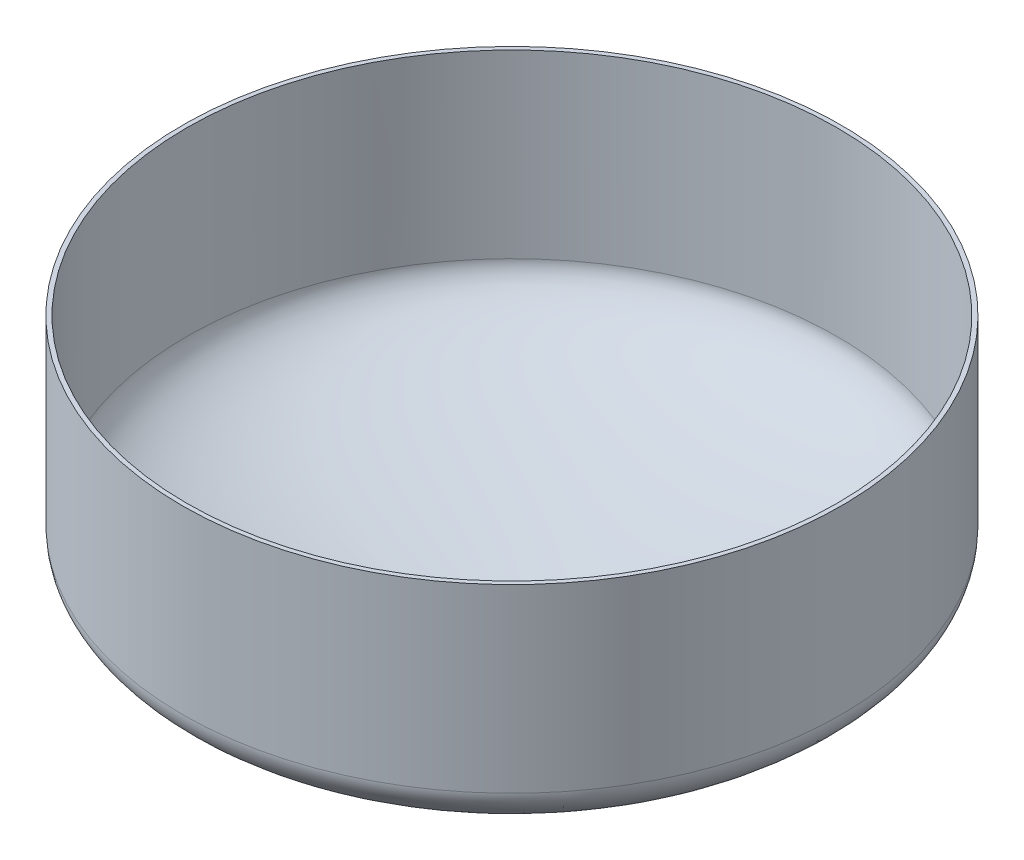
from build123d import *

# Parameters (mm, degrees)
WANDUNG1_T              = -2.5
SKIZZE2_R               = 9.25
LINEAR_AUSTRAGEN1_DEPTH = 316.317300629
SKIZZE4_R               = 15
LINEAR_AUSTRAGEN2_DEPTH = 378.274577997


with BuildPart() as part:
    # Skizze1 → Rotation1 (revolve)
    with BuildSketch(Plane(origin=(0, 0, 0), x_dir=(0, 0, -1), z_dir=(1, 0, 0)), mode=Mode.PRIVATE) as rotation1_sk:
        with BuildLine():
            Line((190, 165), (0, 165))
            Line((0, 165), (0, 0))
            Line((0, 0), (30, 0))
            add(Edge.make_bspline(
                [(30, 0), (190, 22.232846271), (190, 60.799834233)],
                knots=[5.326795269, 5.326795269, 5.326795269, 6.283185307, 6.283185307, 6.283185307], degree=2, weights=[1, 0.88782698, 1]))
            Line((190, 60.799834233), (190, 165))
        make_face()
    revolve(rotation1_sk.sketch.rotate(Axis((0, 182.531914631, 0), (0, -1, 0)), 180), axis=Axis((0, 182.531914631, 0), (0, -1, 0)))

    # Wandung1
    wandung1_openings = [part.faces().sort_by_distance(p)[0] for p in [
        (0, 165, 0),
    ]]
    offset(amount=WANDUNG1_T, openings=wandung1_openings, kind=Kind.INTERSECTION)

    # Skizze2 → Linear austragen1 (cut, through all)
    with BuildSketch(Plane.XZ):
        with Locations(Location((0, 0, 0), (0, 0, 270))):
            Circle(SKIZZE2_R)
    extrude(amount=-LINEAR_AUSTRAGEN1_DEPTH, mode=Mode.SUBTRACT)

    # Skizze4 → Linear austragen2 (cut, through all)
    with BuildSketch(Plane(origin=(97.850770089, 12.101205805, 0), x_dir=(0.9750776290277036, 0.2218639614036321, 0), z_dir=(0.2218639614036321, -0.9750776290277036, 0))):
        Circle(SKIZZE4_R)
    extrude(amount=-LINEAR_AUSTRAGEN2_DEPTH, mode=Mode.SUBTRACT)


solid = part.part
